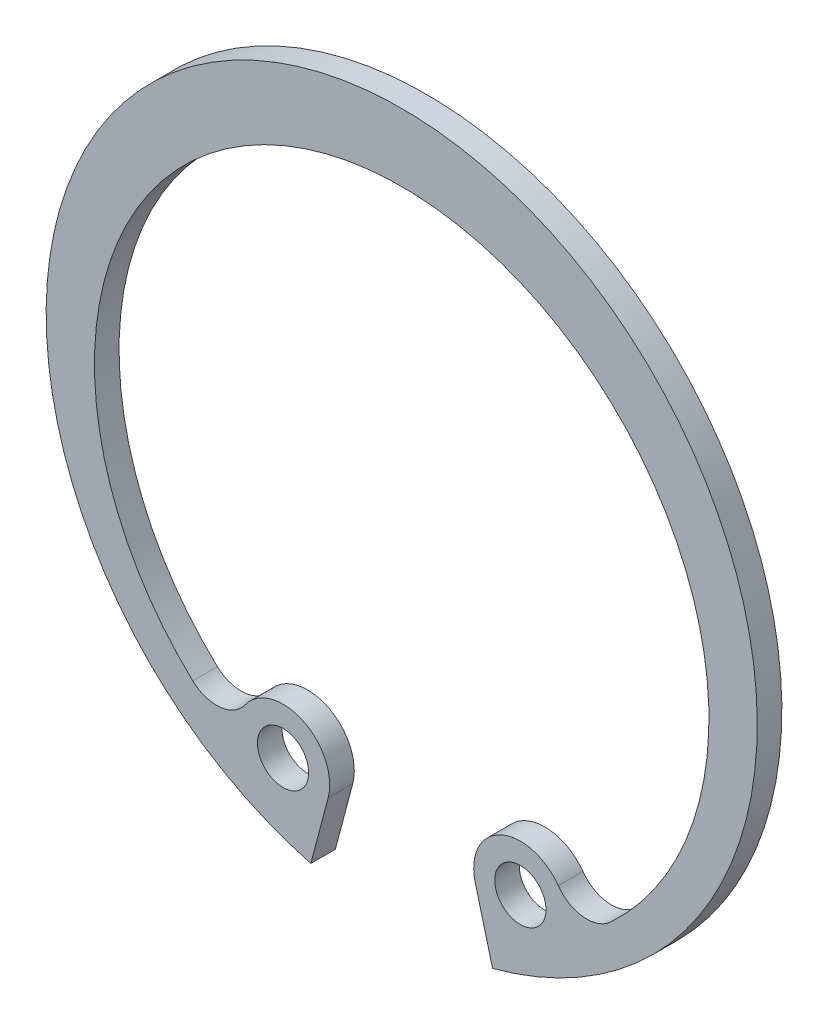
ISO-10303-21;
HEADER;
FILE_DESCRIPTION(('STEP AP214'),'2;1');
FILE_NAME('part.step','',(''),(''),'','','');
FILE_SCHEMA(('AUTOMOTIVE_DESIGN { 1 0 10303 214 1 1 1 1 }'));
ENDSEC;
DATA;
#1=APPLICATION_CONTEXT('core data for automotive mechanical design processes');
#2=APPLICATION_PROTOCOL_DEFINITION('international standard','automotive_design',2000,#1);
#3=PRODUCT_CONTEXT('',#1,'mechanical');
#4=PRODUCT('Part','Part','',(#3));
#5=PRODUCT_RELATED_PRODUCT_CATEGORY('part','',(#4));
#6=PRODUCT_DEFINITION_FORMATION('','',#4);
#7=PRODUCT_DEFINITION_CONTEXT('part definition',#1,'design');
#8=PRODUCT_DEFINITION('design','',#6,#7);
#9=PRODUCT_DEFINITION_SHAPE('','',#8);
#10=(LENGTH_UNIT() NAMED_UNIT(*) SI_UNIT(.MILLI.,.METRE.));
#11=(NAMED_UNIT(*) PLANE_ANGLE_UNIT() SI_UNIT($,.RADIAN.));
#12=(NAMED_UNIT(*) SI_UNIT($,.STERADIAN.) SOLID_ANGLE_UNIT());
#13=UNCERTAINTY_MEASURE_WITH_UNIT(LENGTH_MEASURE(1.E-05),#10,'distance_accuracy_value','');
#14=(GEOMETRIC_REPRESENTATION_CONTEXT(3) GLOBAL_UNCERTAINTY_ASSIGNED_CONTEXT((#13)) GLOBAL_UNIT_ASSIGNED_CONTEXT((#10,
#11,#12)) REPRESENTATION_CONTEXT('',''));
#15=CARTESIAN_POINT('',(0.,0.,0.));
#16=DIRECTION('',(0.,0.,1.));
#17=DIRECTION('',(1.,0.,0.));
#18=AXIS2_PLACEMENT_3D('',#15,#16,#17);
#19=CARTESIAN_POINT('',(0.,0.,-1.2));
#20=DIRECTION('',(0.,0.,1.));
#21=DIRECTION('',(1.,0.,0.));
#22=AXIS2_PLACEMENT_3D('',#19,#20,#21);
#23=CYLINDRICAL_SURFACE('',#22,17.35);
#24=CARTESIAN_POINT('',(0.,0.,0.));
#25=DIRECTION('',(0.,0.,1.));
#26=DIRECTION('',(1.,0.,0.));
#27=AXIS2_PLACEMENT_3D('',#24,#25,#26);
#28=CIRCLE('',#27,17.35);
#29=CARTESIAN_POINT('',(4.43485245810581,-16.7736276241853,0.));
#30=VERTEX_POINT('',#29);
#31=CARTESIAN_POINT('',(-4.43485245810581,-16.7736276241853,0.));
#32=VERTEX_POINT('',#31);
#33=EDGE_CURVE('E113',#30,#32,#28,.T.);
#34=ORIENTED_EDGE('',*,*,#33,.F.);
#35=DIRECTION('',(0.,0.,1.));
#36=VECTOR('',#35,1.);
#37=CARTESIAN_POINT('',(4.43485245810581,-16.7736276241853,-1.2));
#38=LINE('',#37,#36);
#39=CARTESIAN_POINT('',(4.43485245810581,-16.7736276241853,-1.2));
#40=VERTEX_POINT('',#39);
#41=EDGE_CURVE('E11',#40,#30,#38,.T.);
#42=ORIENTED_EDGE('',*,*,#41,.F.);
#43=CARTESIAN_POINT('',(0.,0.,-1.2));
#44=DIRECTION('',(0.,0.,1.));
#45=DIRECTION('',(1.,0.,0.));
#46=AXIS2_PLACEMENT_3D('',#43,#44,#45);
#47=CIRCLE('',#46,17.35);
#48=CARTESIAN_POINT('',(-4.43485245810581,-16.7736276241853,-1.2));
#49=VERTEX_POINT('',#48);
#50=EDGE_CURVE('E134',#40,#49,#47,.T.);
#51=ORIENTED_EDGE('',*,*,#50,.T.);
#52=DIRECTION('',(0.,0.,1.));
#53=VECTOR('',#52,1.);
#54=CARTESIAN_POINT('',(-4.43485245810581,-16.7736276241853,-1.2));
#55=LINE('',#54,#53);
#56=EDGE_CURVE('E19',#49,#32,#55,.T.);
#57=ORIENTED_EDGE('',*,*,#56,.T.);
#58=EDGE_LOOP('',(#34,#42,#51,#57));
#59=FACE_BOUND('',#58,.T.);
#60=ADVANCED_FACE('F16',(#59),#23,.T.);
#61=CARTESIAN_POINT('',(4.43485245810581,-16.7736276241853,-1.2));
#62=DIRECTION('',(-0.966779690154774,-0.255611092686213,0.));
#63=DIRECTION('',(0.255611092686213,-0.966779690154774,0.));
#64=AXIS2_PLACEMENT_3D('',#61,#62,#63);
#65=PLANE('',#64);
#66=DIRECTION('',(0.255611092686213,-0.966779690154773,0.));
#67=VECTOR('',#66,1.);
#68=CARTESIAN_POINT('',(4.43485245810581,-16.7736276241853,0.));
#69=LINE('',#68,#67);
#70=CARTESIAN_POINT('',(3.58926580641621,-13.5754252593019,0.));
#71=VERTEX_POINT('',#70);
#72=EDGE_CURVE('E132',#71,#30,#69,.T.);
#73=ORIENTED_EDGE('',*,*,#72,.F.);
#74=DIRECTION('',(0.,0.,1.));
#75=VECTOR('',#74,1.);
#76=CARTESIAN_POINT('',(3.58926580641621,-13.5754252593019,-1.2));
#77=LINE('',#76,#75);
#78=CARTESIAN_POINT('',(3.58926580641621,-13.5754252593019,-1.2));
#79=VERTEX_POINT('',#78);
#80=EDGE_CURVE('E25',#79,#71,#77,.T.);
#81=ORIENTED_EDGE('',*,*,#80,.F.);
#82=DIRECTION('',(0.255611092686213,-0.966779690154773,0.));
#83=VECTOR('',#82,1.);
#84=CARTESIAN_POINT('',(4.43485245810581,-16.7736276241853,-1.2));
#85=LINE('',#84,#83);
#86=EDGE_CURVE('E103',#79,#40,#85,.T.);
#87=ORIENTED_EDGE('',*,*,#86,.T.);
#88=ORIENTED_EDGE('',*,*,#41,.T.);
#89=EDGE_LOOP('',(#73,#81,#87,#88));
#90=FACE_BOUND('',#89,.T.);
#91=ADVANCED_FACE('F146',(#90),#65,.T.);
#92=CARTESIAN_POINT('',(5.78868960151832,-12.9939100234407,-1.2));
#93=DIRECTION('',(0.,0.,1.));
#94=DIRECTION('',(1.,0.,0.));
#95=AXIS2_PLACEMENT_3D('',#92,#93,#94);
#96=CYLINDRICAL_SURFACE('',#95,2.275);
#97=CARTESIAN_POINT('',(5.78868960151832,-12.9939100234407,0.));
#98=DIRECTION('',(0.,0.,1.));
#99=DIRECTION('',(1.,0.,0.));
#100=AXIS2_PLACEMENT_3D('',#97,#98,#99);
#101=CIRCLE('',#100,2.275);
#102=CARTESIAN_POINT('',(7.64243030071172,-11.6750960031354,0.));
#103=VERTEX_POINT('',#102);
#104=EDGE_CURVE('E90',#103,#71,#101,.T.);
#105=ORIENTED_EDGE('',*,*,#104,.F.);
#106=DIRECTION('',(0.,0.,1.));
#107=VECTOR('',#106,1.);
#108=CARTESIAN_POINT('',(7.64243030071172,-11.6750960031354,-1.2));
#109=LINE('',#108,#107);
#110=CARTESIAN_POINT('',(7.64243030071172,-11.6750960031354,-1.2));
#111=VERTEX_POINT('',#110);
#112=EDGE_CURVE('E85',#111,#103,#109,.T.);
#113=ORIENTED_EDGE('',*,*,#112,.F.);
#114=CARTESIAN_POINT('',(5.78868960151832,-12.9939100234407,-1.2));
#115=DIRECTION('',(0.,0.,1.));
#116=DIRECTION('',(1.,0.,0.));
#117=AXIS2_PLACEMENT_3D('',#114,#115,#116);
#118=CIRCLE('',#117,2.275);
#119=EDGE_CURVE('E88',#111,#79,#118,.T.);
#120=ORIENTED_EDGE('',*,*,#119,.T.);
#121=ORIENTED_EDGE('',*,*,#80,.T.);
#122=EDGE_LOOP('',(#105,#113,#120,#121));
#123=FACE_BOUND('',#122,.T.);
#124=ADVANCED_FACE('F87',(#123),#96,.T.);
#125=CARTESIAN_POINT('',(9.03273582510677,-10.6859854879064,-1.2));
#126=DIRECTION('',(0.,0.,1.));
#127=DIRECTION('',(1.,0.,0.));
#128=AXIS2_PLACEMENT_3D('',#125,#126,#127);
#129=CYLINDRICAL_SURFACE('',#128,1.70625);
#130=CARTESIAN_POINT('',(9.03273582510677,-10.6859854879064,0.));
#131=DIRECTION('',(0.,0.,-1.));
#132=DIRECTION('',(1.,0.,0.));
#133=AXIS2_PLACEMENT_3D('',#130,#131,#132);
#134=CIRCLE('',#133,1.70625);
#135=CARTESIAN_POINT('',(10.1927373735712,-11.9372590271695,0.));
#136=VERTEX_POINT('',#135);
#137=EDGE_CURVE('E129',#136,#103,#134,.T.);
#138=ORIENTED_EDGE('',*,*,#137,.F.);
#139=DIRECTION('',(0.,0.,1.));
#140=VECTOR('',#139,1.);
#141=CARTESIAN_POINT('',(10.1927373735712,-11.9372590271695,-1.2));
#142=LINE('',#141,#140);
#143=CARTESIAN_POINT('',(10.1927373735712,-11.9372590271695,-1.2));
#144=VERTEX_POINT('',#143);
#145=EDGE_CURVE('E95',#144,#136,#142,.T.);
#146=ORIENTED_EDGE('',*,*,#145,.F.);
#147=CARTESIAN_POINT('',(9.03273582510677,-10.6859854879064,-1.2));
#148=DIRECTION('',(0.,0.,-1.));
#149=DIRECTION('',(1.,0.,0.));
#150=AXIS2_PLACEMENT_3D('',#147,#148,#149);
#151=CIRCLE('',#150,1.70625);
#152=EDGE_CURVE('E101',#144,#111,#151,.T.);
#153=ORIENTED_EDGE('',*,*,#152,.T.);
#154=ORIENTED_EDGE('',*,*,#112,.T.);
#155=EDGE_LOOP('',(#138,#146,#153,#154));
#156=FACE_BOUND('',#155,.T.);
#157=ADVANCED_FACE('F105',(#156),#129,.F.);
#158=CARTESIAN_POINT('',(0.,-0.942530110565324,-1.2));
#159=DIRECTION('',(0.,0.,1.));
#160=DIRECTION('',(1.,0.,0.));
#161=AXIS2_PLACEMENT_3D('',#158,#159,#160);
#162=CYLINDRICAL_SURFACE('',#161,14.9925301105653);
#163=CARTESIAN_POINT('',(0.,-0.942530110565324,0.));
#164=DIRECTION('',(0.,0.,-1.));
#165=DIRECTION('',(1.,0.,0.));
#166=AXIS2_PLACEMENT_3D('',#163,#164,#165);
#167=CIRCLE('',#166,14.9925301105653);
#168=CARTESIAN_POINT('',(-10.1927373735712,-11.9372590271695,0.));
#169=VERTEX_POINT('',#168);
#170=EDGE_CURVE('E126',#169,#136,#167,.T.);
#171=ORIENTED_EDGE('',*,*,#170,.F.);
#172=DIRECTION('',(0.,0.,1.));
#173=VECTOR('',#172,1.);
#174=CARTESIAN_POINT('',(-10.1927373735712,-11.9372590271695,-1.2));
#175=LINE('',#174,#173);
#176=CARTESIAN_POINT('',(-10.1927373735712,-11.9372590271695,-1.2));
#177=VERTEX_POINT('',#176);
#178=EDGE_CURVE('E138',#177,#169,#175,.T.);
#179=ORIENTED_EDGE('',*,*,#178,.F.);
#180=CARTESIAN_POINT('',(0.,-0.942530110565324,-1.2));
#181=DIRECTION('',(0.,0.,-1.));
#182=DIRECTION('',(1.,0.,0.));
#183=AXIS2_PLACEMENT_3D('',#180,#181,#182);
#184=CIRCLE('',#183,14.9925301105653);
#185=EDGE_CURVE('E106',#177,#144,#184,.T.);
#186=ORIENTED_EDGE('',*,*,#185,.T.);
#187=ORIENTED_EDGE('',*,*,#145,.T.);
#188=EDGE_LOOP('',(#171,#179,#186,#187));
#189=FACE_BOUND('',#188,.T.);
#190=ADVANCED_FACE('F161',(#189),#162,.F.);
#191=CARTESIAN_POINT('',(-9.03273582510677,-10.6859854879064,-1.2));
#192=DIRECTION('',(0.,0.,1.));
#193=DIRECTION('',(1.,0.,0.));
#194=AXIS2_PLACEMENT_3D('',#191,#192,#193);
#195=CYLINDRICAL_SURFACE('',#194,1.70625);
#196=CARTESIAN_POINT('',(-9.03273582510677,-10.6859854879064,0.));
#197=DIRECTION('',(0.,0.,-1.));
#198=DIRECTION('',(1.,0.,0.));
#199=AXIS2_PLACEMENT_3D('',#196,#197,#198);
#200=CIRCLE('',#199,1.70625);
#201=CARTESIAN_POINT('',(-7.64243030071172,-11.6750960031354,0.));
#202=VERTEX_POINT('',#201);
#203=EDGE_CURVE('E123',#202,#169,#200,.T.);
#204=ORIENTED_EDGE('',*,*,#203,.F.);
#205=DIRECTION('',(0.,0.,1.));
#206=VECTOR('',#205,1.);
#207=CARTESIAN_POINT('',(-7.64243030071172,-11.6750960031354,-1.2));
#208=LINE('',#207,#206);
#209=CARTESIAN_POINT('',(-7.64243030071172,-11.6750960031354,-1.2));
#210=VERTEX_POINT('',#209);
#211=EDGE_CURVE('E140',#210,#202,#208,.T.);
#212=ORIENTED_EDGE('',*,*,#211,.F.);
#213=CARTESIAN_POINT('',(-9.03273582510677,-10.6859854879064,-1.2));
#214=DIRECTION('',(0.,0.,-1.));
#215=DIRECTION('',(1.,0.,0.));
#216=AXIS2_PLACEMENT_3D('',#213,#214,#215);
#217=CIRCLE('',#216,1.70625);
#218=EDGE_CURVE('E108',#210,#177,#217,.T.);
#219=ORIENTED_EDGE('',*,*,#218,.T.);
#220=ORIENTED_EDGE('',*,*,#178,.T.);
#221=EDGE_LOOP('',(#204,#212,#219,#220));
#222=FACE_BOUND('',#221,.T.);
#223=ADVANCED_FACE('F164',(#222),#195,.F.);
#224=CARTESIAN_POINT('',(-5.78868960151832,-12.9939100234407,-1.2));
#225=DIRECTION('',(0.,0.,1.));
#226=DIRECTION('',(1.,0.,0.));
#227=AXIS2_PLACEMENT_3D('',#224,#225,#226);
#228=CYLINDRICAL_SURFACE('',#227,2.275);
#229=CARTESIAN_POINT('',(-5.78868960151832,-12.9939100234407,0.));
#230=DIRECTION('',(0.,0.,1.));
#231=DIRECTION('',(1.,0.,0.));
#232=AXIS2_PLACEMENT_3D('',#229,#230,#231);
#233=CIRCLE('',#232,2.275);
#234=CARTESIAN_POINT('',(-3.58926580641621,-13.5754252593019,0.));
#235=VERTEX_POINT('',#234);
#236=EDGE_CURVE('E120',#235,#202,#233,.T.);
#237=ORIENTED_EDGE('',*,*,#236,.F.);
#238=DIRECTION('',(0.,0.,1.));
#239=VECTOR('',#238,1.);
#240=CARTESIAN_POINT('',(-3.58926580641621,-13.5754252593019,-1.2));
#241=LINE('',#240,#239);
#242=CARTESIAN_POINT('',(-3.58926580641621,-13.5754252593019,-1.2));
#243=VERTEX_POINT('',#242);
#244=EDGE_CURVE('E141',#243,#235,#241,.T.);
#245=ORIENTED_EDGE('',*,*,#244,.F.);
#246=CARTESIAN_POINT('',(-5.78868960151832,-12.9939100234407,-1.2));
#247=DIRECTION('',(0.,0.,1.));
#248=DIRECTION('',(1.,0.,0.));
#249=AXIS2_PLACEMENT_3D('',#246,#247,#248);
#250=CIRCLE('',#249,2.275);
#251=EDGE_CURVE('E213',#243,#210,#250,.T.);
#252=ORIENTED_EDGE('',*,*,#251,.T.);
#253=ORIENTED_EDGE('',*,*,#211,.T.);
#254=EDGE_LOOP('',(#237,#245,#252,#253));
#255=FACE_BOUND('',#254,.T.);
#256=ADVANCED_FACE('F168',(#255),#228,.T.);
#257=CARTESIAN_POINT('',(-4.43485245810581,-16.7736276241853,-1.2));
#258=DIRECTION('',(0.966779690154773,-0.255611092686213,0.));
#259=DIRECTION('',(0.255611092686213,0.966779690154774,0.));
#260=AXIS2_PLACEMENT_3D('',#257,#258,#259);
#261=PLANE('',#260);
#262=DIRECTION('',(0.255611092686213,0.966779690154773,0.));
#263=VECTOR('',#262,1.);
#264=CARTESIAN_POINT('',(-4.43485245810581,-16.7736276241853,0.));
#265=LINE('',#264,#263);
#266=EDGE_CURVE('E116',#32,#235,#265,.T.);
#267=ORIENTED_EDGE('',*,*,#266,.F.);
#268=ORIENTED_EDGE('',*,*,#56,.F.);
#269=DIRECTION('',(0.255611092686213,0.966779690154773,0.));
#270=VECTOR('',#269,1.);
#271=CARTESIAN_POINT('',(-4.43485245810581,-16.7736276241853,-1.2));
#272=LINE('',#271,#270);
#273=EDGE_CURVE('E211',#49,#243,#272,.T.);
#274=ORIENTED_EDGE('',*,*,#273,.T.);
#275=ORIENTED_EDGE('',*,*,#244,.T.);
#276=EDGE_LOOP('',(#267,#268,#274,#275));
#277=FACE_BOUND('',#276,.T.);
#278=ADVANCED_FACE('F143',(#277),#261,.T.);
#279=CARTESIAN_POINT('',(0.,0.,-1.2));
#280=DIRECTION('',(0.,0.,1.));
#281=DIRECTION('',(1.,0.,0.));
#282=AXIS2_PLACEMENT_3D('',#279,#280,#281);
#283=PLANE('',#282);
#284=CARTESIAN_POINT('',(-5.78868960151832,-12.9939100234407,-1.2));
#285=DIRECTION('',(0.,0.,1.));
#286=DIRECTION('',(1.,0.,0.));
#287=AXIS2_PLACEMENT_3D('',#284,#285,#286);
#288=CIRCLE('',#287,1.25);
#289=CARTESIAN_POINT('',(-4.53868960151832,-12.9939100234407,-1.2));
#290=VERTEX_POINT('',#289);
#291=EDGE_CURVE('E198',#290,#290,#288,.T.);
#292=ORIENTED_EDGE('',*,*,#291,.T.);
#293=EDGE_LOOP('',(#292));
#294=FACE_BOUND('',#293,.T.);
#295=CARTESIAN_POINT('',(5.78868960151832,-12.9939100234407,-1.2));
#296=DIRECTION('',(0.,0.,1.));
#297=DIRECTION('',(1.,0.,0.));
#298=AXIS2_PLACEMENT_3D('',#295,#296,#297);
#299=CIRCLE('',#298,1.25);
#300=CARTESIAN_POINT('',(7.03868960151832,-12.9939100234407,-1.2));
#301=VERTEX_POINT('',#300);
#302=EDGE_CURVE('E117',#301,#301,#299,.T.);
#303=ORIENTED_EDGE('',*,*,#302,.T.);
#304=EDGE_LOOP('',(#303));
#305=FACE_BOUND('',#304,.T.);
#306=ORIENTED_EDGE('',*,*,#50,.F.);
#307=ORIENTED_EDGE('',*,*,#86,.F.);
#308=ORIENTED_EDGE('',*,*,#119,.F.);
#309=ORIENTED_EDGE('',*,*,#152,.F.);
#310=ORIENTED_EDGE('',*,*,#185,.F.);
#311=ORIENTED_EDGE('',*,*,#218,.F.);
#312=ORIENTED_EDGE('',*,*,#251,.F.);
#313=ORIENTED_EDGE('',*,*,#273,.F.);
#314=EDGE_LOOP('',(#306,#307,#308,#309,#310,#311,#312,#313));
#315=FACE_BOUND('',#314,.T.);
#316=ADVANCED_FACE('F99',(#294,#305,#315),#283,.F.);
#317=CARTESIAN_POINT('',(0.,0.,0.));
#318=DIRECTION('',(0.,0.,1.));
#319=DIRECTION('',(1.,0.,0.));
#320=AXIS2_PLACEMENT_3D('',#317,#318,#319);
#321=PLANE('',#320);
#322=CARTESIAN_POINT('',(-5.78868960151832,-12.9939100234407,0.));
#323=DIRECTION('',(0.,0.,1.));
#324=DIRECTION('',(1.,0.,0.));
#325=AXIS2_PLACEMENT_3D('',#322,#323,#324);
#326=CIRCLE('',#325,1.25);
#327=CARTESIAN_POINT('',(-4.53868960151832,-12.9939100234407,0.));
#328=VERTEX_POINT('',#327);
#329=EDGE_CURVE('E201',#328,#328,#326,.T.);
#330=ORIENTED_EDGE('',*,*,#329,.F.);
#331=EDGE_LOOP('',(#330));
#332=FACE_BOUND('',#331,.T.);
#333=CARTESIAN_POINT('',(5.78868960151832,-12.9939100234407,0.));
#334=DIRECTION('',(0.,0.,1.));
#335=DIRECTION('',(1.,0.,0.));
#336=AXIS2_PLACEMENT_3D('',#333,#334,#335);
#337=CIRCLE('',#336,1.25);
#338=CARTESIAN_POINT('',(7.03868960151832,-12.9939100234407,0.));
#339=VERTEX_POINT('',#338);
#340=EDGE_CURVE('E203',#339,#339,#337,.T.);
#341=ORIENTED_EDGE('',*,*,#340,.F.);
#342=EDGE_LOOP('',(#341));
#343=FACE_BOUND('',#342,.T.);
#344=ORIENTED_EDGE('',*,*,#33,.T.);
#345=ORIENTED_EDGE('',*,*,#266,.T.);
#346=ORIENTED_EDGE('',*,*,#236,.T.);
#347=ORIENTED_EDGE('',*,*,#203,.T.);
#348=ORIENTED_EDGE('',*,*,#170,.T.);
#349=ORIENTED_EDGE('',*,*,#137,.T.);
#350=ORIENTED_EDGE('',*,*,#104,.T.);
#351=ORIENTED_EDGE('',*,*,#72,.T.);
#352=EDGE_LOOP('',(#344,#345,#346,#347,#348,#349,#350,#351));
#353=FACE_BOUND('',#352,.T.);
#354=ADVANCED_FACE('F145',(#332,#343,#353),#321,.T.);
#355=CARTESIAN_POINT('',(5.78868960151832,-12.9939100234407,-1.2));
#356=DIRECTION('',(0.,0.,1.));
#357=DIRECTION('',(1.,0.,0.));
#358=AXIS2_PLACEMENT_3D('',#355,#356,#357);
#359=CYLINDRICAL_SURFACE('',#358,1.25);
#360=ORIENTED_EDGE('',*,*,#302,.F.);
#361=EDGE_LOOP('',(#360));
#362=FACE_BOUND('',#361,.T.);
#363=ORIENTED_EDGE('',*,*,#340,.T.);
#364=EDGE_LOOP('',(#363));
#365=FACE_BOUND('',#364,.T.);
#366=ADVANCED_FACE('F182',(#362,#365),#359,.F.);
#367=CARTESIAN_POINT('',(-5.78868960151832,-12.9939100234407,-1.2));
#368=DIRECTION('',(0.,0.,1.));
#369=DIRECTION('',(1.,0.,0.));
#370=AXIS2_PLACEMENT_3D('',#367,#368,#369);
#371=CYLINDRICAL_SURFACE('',#370,1.25);
#372=ORIENTED_EDGE('',*,*,#291,.F.);
#373=EDGE_LOOP('',(#372));
#374=FACE_BOUND('',#373,.T.);
#375=ORIENTED_EDGE('',*,*,#329,.T.);
#376=EDGE_LOOP('',(#375));
#377=FACE_BOUND('',#376,.T.);
#378=ADVANCED_FACE('F189',(#374,#377),#371,.F.);
#379=CLOSED_SHELL('',(#60,#91,#124,#157,#190,#223,#256,#278,#316,#354,#366,#378));
#380=MANIFOLD_SOLID_BREP('B1',#379);
#381=ADVANCED_BREP_SHAPE_REPRESENTATION('',(#18,#380),#14);
#382=SHAPE_DEFINITION_REPRESENTATION(#9,#381);
ENDSEC;
END-ISO-10303-21;
